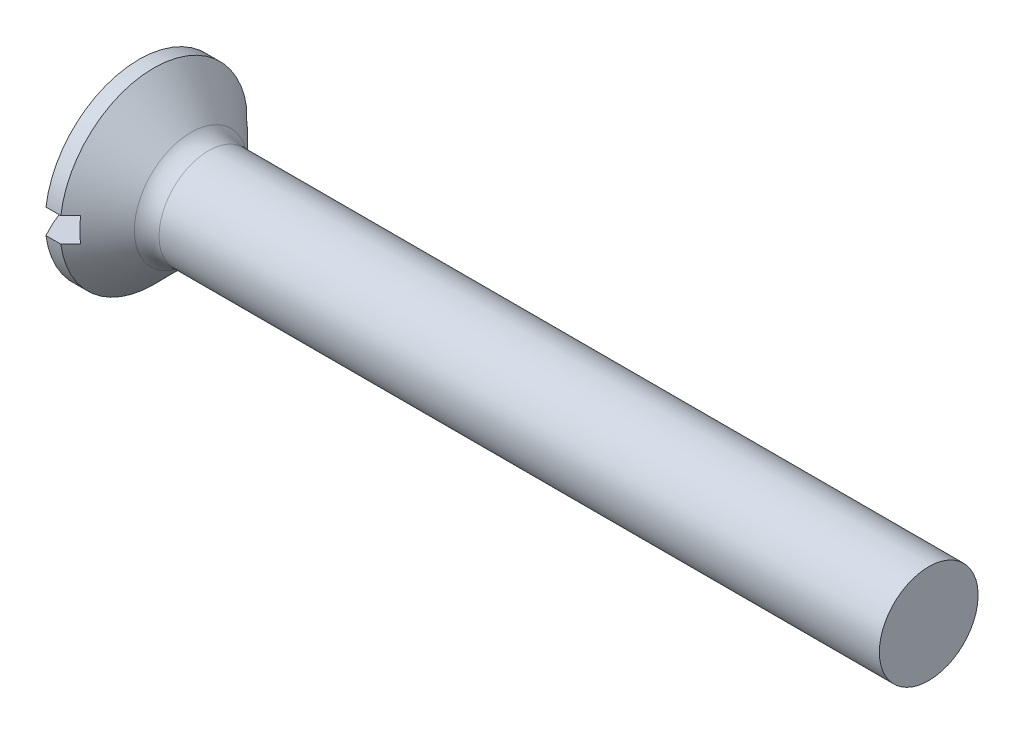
ISO-10303-21;
HEADER;
FILE_DESCRIPTION(('STEP AP214'),'2;1');
FILE_NAME('part.step','',(''),(''),'','','');
FILE_SCHEMA(('AUTOMOTIVE_DESIGN { 1 0 10303 214 1 1 1 1 }'));
ENDSEC;
DATA;
#1=APPLICATION_CONTEXT('core data for automotive mechanical design processes');
#2=APPLICATION_PROTOCOL_DEFINITION('international standard','automotive_design',2000,#1);
#3=PRODUCT_CONTEXT('',#1,'mechanical');
#4=PRODUCT('Part','Part','',(#3));
#5=PRODUCT_RELATED_PRODUCT_CATEGORY('part','',(#4));
#6=PRODUCT_DEFINITION_FORMATION('','',#4);
#7=PRODUCT_DEFINITION_CONTEXT('part definition',#1,'design');
#8=PRODUCT_DEFINITION('design','',#6,#7);
#9=PRODUCT_DEFINITION_SHAPE('','',#8);
#10=(LENGTH_UNIT() NAMED_UNIT(*) SI_UNIT(.MILLI.,.METRE.));
#11=(NAMED_UNIT(*) PLANE_ANGLE_UNIT() SI_UNIT($,.RADIAN.));
#12=(NAMED_UNIT(*) SI_UNIT($,.STERADIAN.) SOLID_ANGLE_UNIT());
#13=UNCERTAINTY_MEASURE_WITH_UNIT(LENGTH_MEASURE(1.E-05),#10,'distance_accuracy_value','');
#14=(GEOMETRIC_REPRESENTATION_CONTEXT(3) GLOBAL_UNCERTAINTY_ASSIGNED_CONTEXT((#13)) GLOBAL_UNIT_ASSIGNED_CONTEXT((#10,
#11,#12)) REPRESENTATION_CONTEXT('',''));
#15=CARTESIAN_POINT('',(0.,0.,0.));
#16=DIRECTION('',(0.,0.,1.));
#17=DIRECTION('',(1.,0.,0.));
#18=AXIS2_PLACEMENT_3D('',#15,#16,#17);
#19=CARTESIAN_POINT('',(3.86,0.,0.));
#20=DIRECTION('',(-1.,0.,0.));
#21=DIRECTION('',(0.,-1.,0.));
#22=AXIS2_PLACEMENT_3D('',#19,#20,#21);
#23=SPHERICAL_SURFACE('',#22,3.86);
#24=CARTESIAN_POINT('',(3.86,0.25,0.));
#25=DIRECTION('',(0.,1.,0.));
#26=DIRECTION('',(0.,0.,1.));
#27=AXIS2_PLACEMENT_3D('',#24,#25,#26);
#28=CIRCLE('',#27,3.85189563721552);
#29=CARTESIAN_POINT('',(0.5,0.25,1.88348082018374));
#30=VERTEX_POINT('',#29);
#31=CARTESIAN_POINT('',(0.5,0.25,-1.88348082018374));
#32=VERTEX_POINT('',#31);
#33=EDGE_CURVE('E180',#30,#32,#28,.F.);
#34=ORIENTED_EDGE('',*,*,#33,.F.);
#35=CARTESIAN_POINT('',(0.5,0.,0.));
#36=DIRECTION('',(-1.,0.,0.));
#37=DIRECTION('',(0.,0.,1.));
#38=AXIS2_PLACEMENT_3D('',#35,#36,#37);
#39=CIRCLE('',#38,1.9);
#40=EDGE_CURVE('E135',#30,#32,#39,.T.);
#41=ORIENTED_EDGE('',*,*,#40,.T.);
#42=EDGE_LOOP('',(#34,#41));
#43=FACE_BOUND('',#42,.T.);
#44=ADVANCED_FACE('F30',(#43),#23,.T.);
#45=CARTESIAN_POINT('',(-15.875,0.,0.));
#46=DIRECTION('',(-1.,0.,0.));
#47=DIRECTION('',(0.,0.,1.));
#48=AXIS2_PLACEMENT_3D('',#45,#46,#47);
#49=CYLINDRICAL_SURFACE('',#48,1.9);
#50=CARTESIAN_POINT('',(0.800000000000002,0.,0.));
#51=DIRECTION('',(-1.,0.,0.));
#52=DIRECTION('',(0.,0.,1.));
#53=AXIS2_PLACEMENT_3D('',#50,#51,#52);
#54=CIRCLE('',#53,1.9);
#55=CARTESIAN_POINT('',(0.800000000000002,0.25,1.88348082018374));
#56=VERTEX_POINT('',#55);
#57=CARTESIAN_POINT('',(0.800000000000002,0.25,-1.88348082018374));
#58=VERTEX_POINT('',#57);
#59=EDGE_CURVE('E106',#56,#58,#54,.T.);
#60=ORIENTED_EDGE('',*,*,#59,.T.);
#61=DIRECTION('',(-1.,0.,0.));
#62=VECTOR('',#61,1.);
#63=CARTESIAN_POINT('',(-15.875,0.25,-1.88348082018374));
#64=LINE('',#63,#62);
#65=EDGE_CURVE('E58',#58,#32,#64,.T.);
#66=ORIENTED_EDGE('',*,*,#65,.T.);
#67=ORIENTED_EDGE('',*,*,#40,.F.);
#68=DIRECTION('',(-1.,0.,0.));
#69=VECTOR('',#68,1.);
#70=CARTESIAN_POINT('',(-15.875,0.25,1.88348082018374));
#71=LINE('',#70,#69);
#72=EDGE_CURVE('E175',#30,#56,#71,.F.);
#73=ORIENTED_EDGE('',*,*,#72,.T.);
#74=EDGE_LOOP('',(#60,#66,#67,#73));
#75=FACE_BOUND('',#74,.T.);
#76=ADVANCED_FACE('F156',(#75),#49,.T.);
#77=CARTESIAN_POINT('',(16.5,0.,0.));
#78=DIRECTION('',(-1.,0.,0.));
#79=DIRECTION('',(0.,0.,1.));
#80=AXIS2_PLACEMENT_3D('',#77,#78,#79);
#81=PLANE('',#80);
#82=CARTESIAN_POINT('',(16.5,0.,0.));
#83=DIRECTION('',(-1.,0.,0.));
#84=DIRECTION('',(0.,0.,1.));
#85=AXIS2_PLACEMENT_3D('',#82,#83,#84);
#86=CIRCLE('',#85,1.);
#87=CARTESIAN_POINT('',(16.5,0.,1.));
#88=VERTEX_POINT('',#87);
#89=EDGE_CURVE('E128',#88,#88,#86,.T.);
#90=ORIENTED_EDGE('',*,*,#89,.F.);
#91=EDGE_LOOP('',(#90));
#92=FACE_BOUND('',#91,.T.);
#93=ADVANCED_FACE('F164',(#92),#81,.F.);
#94=CARTESIAN_POINT('',(3.86,-0.25,0.));
#95=DIRECTION('',(0.,-1.,0.));
#96=DIRECTION('',(0.,0.,-1.));
#97=AXIS2_PLACEMENT_3D('',#94,#95,#96);
#98=CIRCLE('',#97,3.85189563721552);
#99=CARTESIAN_POINT('',(0.5,-0.25,-1.88348082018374));
#100=VERTEX_POINT('',#99);
#101=CARTESIAN_POINT('',(0.5,-0.25,1.88348082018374));
#102=VERTEX_POINT('',#101);
#103=EDGE_CURVE('E126',#100,#102,#98,.F.);
#104=ORIENTED_EDGE('',*,*,#103,.F.);
#105=EDGE_CURVE('E125',#100,#102,#39,.T.);
#106=ORIENTED_EDGE('',*,*,#105,.T.);
#107=EDGE_LOOP('',(#104,#106));
#108=FACE_BOUND('',#107,.T.);
#109=ADVANCED_FACE('F154',(#108),#23,.T.);
#110=CARTESIAN_POINT('',(0.800000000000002,-0.25,-1.88348082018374));
#111=VERTEX_POINT('',#110);
#112=CARTESIAN_POINT('',(0.800000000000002,-0.25,1.88348082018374));
#113=VERTEX_POINT('',#112);
#114=EDGE_CURVE('E123',#111,#113,#54,.T.);
#115=ORIENTED_EDGE('',*,*,#114,.T.);
#116=DIRECTION('',(-1.,0.,0.));
#117=VECTOR('',#116,1.);
#118=CARTESIAN_POINT('',(-15.875,-0.25,1.88348082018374));
#119=LINE('',#118,#117);
#120=EDGE_CURVE('E173',#113,#102,#119,.T.);
#121=ORIENTED_EDGE('',*,*,#120,.T.);
#122=ORIENTED_EDGE('',*,*,#105,.F.);
#123=DIRECTION('',(-1.,0.,0.));
#124=VECTOR('',#123,1.);
#125=CARTESIAN_POINT('',(-15.875,-0.25,-1.88348082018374));
#126=LINE('',#125,#124);
#127=EDGE_CURVE('E115',#100,#111,#126,.F.);
#128=ORIENTED_EDGE('',*,*,#127,.T.);
#129=EDGE_LOOP('',(#115,#121,#122,#128));
#130=FACE_BOUND('',#129,.T.);
#131=ADVANCED_FACE('F121',(#130),#49,.T.);
#132=CARTESIAN_POINT('',(0.800000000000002,0.,0.));
#133=DIRECTION('',(-1.,0.,0.));
#134=DIRECTION('',(0.,0.,1.));
#135=AXIS2_PLACEMENT_3D('',#132,#133,#134);
#136=CONICAL_SURFACE('',#135,1.9,0.78539816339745);
#137=CARTESIAN_POINT('',(-1.48335571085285,0.25,-4.17587894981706));
#138=CARTESIAN_POINT('',(-1.34091780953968,0.25,-4.03318397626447));
#139=CARTESIAN_POINT('',(-1.19849104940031,0.25,-3.89047787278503));
#140=CARTESIAN_POINT('',(-0.913672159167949,0.25,-3.60502718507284));
#141=CARTESIAN_POINT('',(-0.77128002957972,0.25,-3.46228260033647));
#142=CARTESIAN_POINT('',(-0.486502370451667,0.25,-3.17669823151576));
#143=CARTESIAN_POINT('',(-0.344116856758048,0.25,-3.03385843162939));
#144=CARTESIAN_POINT('',(-0.0594245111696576,0.25,-2.74810424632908));
#145=CARTESIAN_POINT('',(0.0828823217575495,0.25,-2.60518986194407));
#146=CARTESIAN_POINT('',(0.370982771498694,0.25,-2.31560790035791));
#147=CARTESIAN_POINT('',(0.516773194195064,0.25,-2.16893714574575));
#148=CARTESIAN_POINT('',(0.808133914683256,0.25,-1.87536527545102));
#149=CARTESIAN_POINT('',(0.953704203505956,0.25,-1.72846415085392));
#150=CARTESIAN_POINT('',(1.17168494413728,0.25,-1.50777115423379));
#151=CARTESIAN_POINT('',(1.2442755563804,0.25,-1.43415726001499));
#152=CARTESIAN_POINT('',(1.38926735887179,0.25,-1.28674053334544));
#153=CARTESIAN_POINT('',(1.46166854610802,0.25,-1.21293769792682));
#154=CARTESIAN_POINT('',(1.60614296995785,0.25,-1.06502260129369));
#155=CARTESIAN_POINT('',(1.67821623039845,0.25,-0.990910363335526));
#156=CARTESIAN_POINT('',(1.82177982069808,0.25,-0.842124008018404));
#157=CARTESIAN_POINT('',(1.89327017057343,0.25,-0.767449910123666));
#158=CARTESIAN_POINT('',(1.98320515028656,0.25,-0.671818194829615));
#159=CARTESIAN_POINT('',(2.00227123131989,0.25,-0.65144645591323));
#160=CARTESIAN_POINT('',(2.04026729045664,0.25,-0.610576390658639));
#161=CARTESIAN_POINT('',(2.0591972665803,0.25,-0.590078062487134));
#162=CARTESIAN_POINT('',(2.11564955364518,0.25,-0.5284372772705));
#163=CARTESIAN_POINT('',(2.15291907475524,0.25,-0.487059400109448));
#164=CARTESIAN_POINT('',(2.21265954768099,0.25,-0.418528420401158));
#165=CARTESIAN_POINT('',(2.23553874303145,0.25,-0.391731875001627));
#166=CARTESIAN_POINT('',(2.28046924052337,0.25,-0.337268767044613));
#167=CARTESIAN_POINT('',(2.30251713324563,0.25,-0.309599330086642));
#168=CARTESIAN_POINT('',(2.33437076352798,0.25,-0.266969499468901));
#169=CARTESIAN_POINT('',(2.34483147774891,0.25,-0.252501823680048));
#170=CARTESIAN_POINT('',(2.3650896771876,0.25,-0.223112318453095));
#171=CARTESIAN_POINT('',(2.37488741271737,0.25,-0.208190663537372));
#172=CARTESIAN_POINT('',(2.39346227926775,0.25,-0.177791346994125));
#173=CARTESIAN_POINT('',(2.40224312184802,0.25,-0.16231599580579));
#174=CARTESIAN_POINT('',(2.41827225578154,0.25,-0.130604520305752));
#175=CARTESIAN_POINT('',(2.42552338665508,0.25,-0.114369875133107));
#176=CARTESIAN_POINT('',(2.4377463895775,0.25,-0.0807694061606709));
#177=CARTESIAN_POINT('',(2.4426867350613,0.25,-0.0633914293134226));
#178=CARTESIAN_POINT('',(2.44901736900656,0.25,-0.0280678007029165));
#179=CARTESIAN_POINT('',(2.45043133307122,0.25,-0.0101267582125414));
#180=CARTESIAN_POINT('',(2.44932721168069,0.25,0.0256677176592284));
#181=CARTESIAN_POINT('',(2.44679929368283,0.25,0.0435208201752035));
#182=CARTESIAN_POINT('',(2.43851921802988,0.25,0.0785328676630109));
#183=CARTESIAN_POINT('',(2.43274442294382,0.25,0.0956860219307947));
#184=CARTESIAN_POINT('',(2.41763500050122,0.25,0.132554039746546));
#185=CARTESIAN_POINT('',(2.40780938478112,0.25,0.152058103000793));
#186=CARTESIAN_POINT('',(2.38634722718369,0.25,0.190062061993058));
#187=CARTESIAN_POINT('',(2.3747061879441,0.25,0.20855930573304));
#188=CARTESIAN_POINT('',(2.3502618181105,0.25,0.24494724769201));
#189=CARTESIAN_POINT('',(2.3374508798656,0.25,0.262832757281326));
#190=CARTESIAN_POINT('',(2.31115223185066,0.25,0.298056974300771));
#191=CARTESIAN_POINT('',(2.29766540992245,0.25,0.315396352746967));
#192=CARTESIAN_POINT('',(2.25226424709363,0.25,0.372219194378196));
#193=CARTESIAN_POINT('',(2.2193791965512,0.25,0.410921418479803));
#194=CARTESIAN_POINT('',(2.1525335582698,0.25,0.487389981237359));
#195=CARTESIAN_POINT('',(2.11857252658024,0.25,0.525155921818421));
#196=CARTESIAN_POINT('',(2.05000356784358,0.25,0.600190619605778));
#197=CARTESIAN_POINT('',(2.01539482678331,0.25,0.63745863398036));
#198=CARTESIAN_POINT('',(1.94582440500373,0.25,0.711648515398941));
#199=CARTESIAN_POINT('',(1.9108627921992,0.25,0.748570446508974));
#200=CARTESIAN_POINT('',(1.80607213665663,0.25,0.858550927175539));
#201=CARTESIAN_POINT('',(1.73590607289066,0.25,0.931288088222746));
#202=CARTESIAN_POINT('',(1.59518965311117,0.25,1.07628878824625));
#203=CARTESIAN_POINT('',(1.52463960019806,0.25,1.14855262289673));
#204=CARTESIAN_POINT('',(1.33310092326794,0.25,1.34407689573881));
#205=CARTESIAN_POINT('',(1.21187584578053,0.25,1.46710567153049));
#206=CARTESIAN_POINT('',(0.969103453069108,0.25,1.71284625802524));
#207=CARTESIAN_POINT('',(0.847556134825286,0.25,1.83555806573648));
#208=CARTESIAN_POINT('',(0.482574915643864,0.25,2.20351484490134));
#209=CARTESIAN_POINT('',(0.23888045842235,0.25,2.44850137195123));
#210=CARTESIAN_POINT('',(-0.251201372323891,0.25,2.94067453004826));
#211=CARTESIAN_POINT('',(-0.497591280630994,0.25,3.18785863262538));
#212=CARTESIAN_POINT('',(-0.990433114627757,0.25,3.68199435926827));
#213=CARTESIAN_POINT('',(-1.23688498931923,0.25,3.92894603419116));
#214=CARTESIAN_POINT('',(-1.48335571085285,0.25,4.17587894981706));
#215=B_SPLINE_CURVE_WITH_KNOTS('',3,(#137,#138,#139,#140,#141,#142,#143,#144,#145,#146,#147,
#148,#149,#150,#151,#152,#153,#154,#155,#156,#157,#158,#159,#160,#161,#162,#163,#164,#165,#166,
#167,#168,#169,#170,#171,#172,#173,#174,#175,#176,#177,#178,#179,#180,#181,#182,#183,#184,#185,
#186,#187,#188,#189,#190,#191,#192,#193,#194,#195,#196,#197,#198,#199,#200,#201,#202,#203,#204,
#205,#206,#207,#208,#209,#210,#211,#212,#213,#214),.UNSPECIFIED.,.F.,.F.,(4,2,2,2,2,2,2,2,2,2,2,
2,2,2,2,2,2,2,2,2,2,2,2,2,2,2,2,2,2,2,2,2,2,2,2,2,2,2,4),(0.,0.604858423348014,1.20972518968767,
1.81478020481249,2.41982708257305,3.04023369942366,3.66066494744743,3.97081901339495,
4.28097798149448,4.59111404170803,4.90123940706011,4.98494476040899,5.06865132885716,
5.23569422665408,5.34139201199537,5.44748437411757,5.50103219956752,5.55455969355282,
5.60788521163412,5.66111085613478,5.71504288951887,5.7686118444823,5.82231463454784,
5.87639657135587,5.94174552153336,6.00725901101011,6.07323385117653,6.13912418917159,
6.2914266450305,6.4437927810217,6.5963653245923,6.74890904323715,7.05209651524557,
7.3550719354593,7.87322475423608,8.39138244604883,9.42803408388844,10.4750640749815,
11.5217315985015),.UNSPECIFIED.);
#216=CARTESIAN_POINT('',(1.,0.25,-1.68151717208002));
#217=VERTEX_POINT('',#216);
#218=EDGE_CURVE('E11',#58,#217,#215,.T.);
#219=ORIENTED_EDGE('',*,*,#218,.F.);
#220=ORIENTED_EDGE('',*,*,#59,.F.);
#221=CARTESIAN_POINT('',(1.,0.25,1.68151717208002));
#222=VERTEX_POINT('',#221);
#223=EDGE_CURVE('E34',#222,#56,#215,.T.);
#224=ORIENTED_EDGE('',*,*,#223,.F.);
#225=CARTESIAN_POINT('',(1.,0.,0.));
#226=DIRECTION('',(-1.,0.,0.));
#227=DIRECTION('',(0.,0.,1.));
#228=AXIS2_PLACEMENT_3D('',#225,#226,#227);
#229=CIRCLE('',#228,1.7);
#230=CARTESIAN_POINT('',(1.,-0.25,1.68151717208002));
#231=VERTEX_POINT('',#230);
#232=EDGE_CURVE('E87',#222,#231,#229,.F.);
#233=ORIENTED_EDGE('',*,*,#232,.T.);
#234=CARTESIAN_POINT('',(-1.48335571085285,-0.25,4.17587894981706));
#235=CARTESIAN_POINT('',(-1.34091780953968,-0.25,4.03318397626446));
#236=CARTESIAN_POINT('',(-1.19849104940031,-0.25,3.89047787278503));
#237=CARTESIAN_POINT('',(-0.913672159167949,-0.25,3.60502718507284));
#238=CARTESIAN_POINT('',(-0.77128002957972,-0.25,3.46228260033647));
#239=CARTESIAN_POINT('',(-0.486502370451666,-0.25,3.17669823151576));
#240=CARTESIAN_POINT('',(-0.344116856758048,-0.25,3.03385843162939));
#241=CARTESIAN_POINT('',(-0.0594245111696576,-0.25,2.74810424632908));
#242=CARTESIAN_POINT('',(0.0828823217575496,-0.25,2.60518986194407));
#243=CARTESIAN_POINT('',(0.370982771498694,-0.25,2.31560790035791));
#244=CARTESIAN_POINT('',(0.516773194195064,-0.25,2.16893714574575));
#245=CARTESIAN_POINT('',(0.808133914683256,-0.25,1.87536527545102));
#246=CARTESIAN_POINT('',(0.953704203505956,-0.25,1.72846415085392));
#247=CARTESIAN_POINT('',(1.17168494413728,-0.25,1.50777115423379));
#248=CARTESIAN_POINT('',(1.2442755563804,-0.25,1.43415726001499));
#249=CARTESIAN_POINT('',(1.38926735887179,-0.25,1.28674053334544));
#250=CARTESIAN_POINT('',(1.46166854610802,-0.25,1.21293769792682));
#251=CARTESIAN_POINT('',(1.60614296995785,-0.25,1.06502260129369));
#252=CARTESIAN_POINT('',(1.67821623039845,-0.25,0.990910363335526));
#253=CARTESIAN_POINT('',(1.82177982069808,-0.25,0.842124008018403));
#254=CARTESIAN_POINT('',(1.89327017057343,-0.25,0.767449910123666));
#255=CARTESIAN_POINT('',(1.98320515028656,-0.25,0.671818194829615));
#256=CARTESIAN_POINT('',(2.00227123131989,-0.25,0.65144645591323));
#257=CARTESIAN_POINT('',(2.04026729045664,-0.25,0.610576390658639));
#258=CARTESIAN_POINT('',(2.0591972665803,-0.25,0.590078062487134));
#259=CARTESIAN_POINT('',(2.11564955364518,-0.25,0.528437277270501));
#260=CARTESIAN_POINT('',(2.15291907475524,-0.25,0.487059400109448));
#261=CARTESIAN_POINT('',(2.21265954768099,-0.25,0.418528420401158));
#262=CARTESIAN_POINT('',(2.23553874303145,-0.25,0.391731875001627));
#263=CARTESIAN_POINT('',(2.28046924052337,-0.25,0.337268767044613));
#264=CARTESIAN_POINT('',(2.30251713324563,-0.25,0.309599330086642));
#265=CARTESIAN_POINT('',(2.33437076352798,-0.25,0.266969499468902));
#266=CARTESIAN_POINT('',(2.34483147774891,-0.25,0.252501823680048));
#267=CARTESIAN_POINT('',(2.3650896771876,-0.25,0.223112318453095));
#268=CARTESIAN_POINT('',(2.37488741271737,-0.25,0.208190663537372));
#269=CARTESIAN_POINT('',(2.39346227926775,-0.25,0.177791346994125));
#270=CARTESIAN_POINT('',(2.40224312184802,-0.25,0.162315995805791));
#271=CARTESIAN_POINT('',(2.41827225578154,-0.25,0.130604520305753));
#272=CARTESIAN_POINT('',(2.42552338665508,-0.25,0.114369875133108));
#273=CARTESIAN_POINT('',(2.4377463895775,-0.25,0.0807694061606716));
#274=CARTESIAN_POINT('',(2.4426867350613,-0.25,0.0633914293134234));
#275=CARTESIAN_POINT('',(2.44901736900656,-0.25,0.0280678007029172));
#276=CARTESIAN_POINT('',(2.45043133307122,-0.25,0.0101267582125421));
#277=CARTESIAN_POINT('',(2.44932721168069,-0.25,-0.0256677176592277));
#278=CARTESIAN_POINT('',(2.44679929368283,-0.25,-0.0435208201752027));
#279=CARTESIAN_POINT('',(2.43851921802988,-0.25,-0.0785328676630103));
#280=CARTESIAN_POINT('',(2.43274442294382,-0.25,-0.0956860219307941));
#281=CARTESIAN_POINT('',(2.41763500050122,-0.25,-0.132554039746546));
#282=CARTESIAN_POINT('',(2.40780938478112,-0.25,-0.152058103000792));
#283=CARTESIAN_POINT('',(2.38634722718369,-0.25,-0.190062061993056));
#284=CARTESIAN_POINT('',(2.3747061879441,-0.25,-0.208559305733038));
#285=CARTESIAN_POINT('',(2.3502618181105,-0.25,-0.244947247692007));
#286=CARTESIAN_POINT('',(2.3374508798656,-0.25,-0.262832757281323));
#287=CARTESIAN_POINT('',(2.31115223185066,-0.25,-0.298056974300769));
#288=CARTESIAN_POINT('',(2.29766540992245,-0.25,-0.315396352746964));
#289=CARTESIAN_POINT('',(2.25226424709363,-0.25,-0.372219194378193));
#290=CARTESIAN_POINT('',(2.21937919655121,-0.25,-0.4109214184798));
#291=CARTESIAN_POINT('',(2.15253355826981,-0.25,-0.487389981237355));
#292=CARTESIAN_POINT('',(2.11857252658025,-0.25,-0.525155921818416));
#293=CARTESIAN_POINT('',(2.05000356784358,-0.25,-0.600190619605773));
#294=CARTESIAN_POINT('',(2.01539482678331,-0.25,-0.637458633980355));
#295=CARTESIAN_POINT('',(1.94582440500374,-0.25,-0.711648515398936));
#296=CARTESIAN_POINT('',(1.91086279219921,-0.25,-0.748570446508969));
#297=CARTESIAN_POINT('',(1.80607213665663,-0.25,-0.858550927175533));
#298=CARTESIAN_POINT('',(1.73590607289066,-0.25,-0.931288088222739));
#299=CARTESIAN_POINT('',(1.59518965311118,-0.25,-1.07628878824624));
#300=CARTESIAN_POINT('',(1.52463960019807,-0.25,-1.14855262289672));
#301=CARTESIAN_POINT('',(1.33310092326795,-0.25,-1.3440768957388));
#302=CARTESIAN_POINT('',(1.21187584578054,-0.25,-1.46710567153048));
#303=CARTESIAN_POINT('',(0.969103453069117,-0.25,-1.71284625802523));
#304=CARTESIAN_POINT('',(0.847556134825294,-0.25,-1.83555806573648));
#305=CARTESIAN_POINT('',(0.482574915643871,-0.25,-2.20351484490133));
#306=CARTESIAN_POINT('',(0.238880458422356,-0.249999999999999,-2.44850137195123));
#307=CARTESIAN_POINT('',(-0.251201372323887,-0.249999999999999,-2.94067453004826));
#308=CARTESIAN_POINT('',(-0.497591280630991,-0.249999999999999,-3.18785863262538));
#309=CARTESIAN_POINT('',(-0.990433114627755,-0.249999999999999,-3.68199435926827));
#310=CARTESIAN_POINT('',(-1.23688498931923,-0.249999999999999,-3.92894603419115));
#311=CARTESIAN_POINT('',(-1.48335571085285,-0.249999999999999,-4.17587894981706));
#312=B_SPLINE_CURVE_WITH_KNOTS('',3,(#234,#235,#236,#237,#238,#239,#240,#241,#242,#243,#244,
#245,#246,#247,#248,#249,#250,#251,#252,#253,#254,#255,#256,#257,#258,#259,#260,#261,#262,#263,
#264,#265,#266,#267,#268,#269,#270,#271,#272,#273,#274,#275,#276,#277,#278,#279,#280,#281,#282,
#283,#284,#285,#286,#287,#288,#289,#290,#291,#292,#293,#294,#295,#296,#297,#298,#299,#300,#301,
#302,#303,#304,#305,#306,#307,#308,#309,#310,#311),.UNSPECIFIED.,.F.,.F.,(4,2,2,2,2,2,2,2,2,2,2,
2,2,2,2,2,2,2,2,2,2,2,2,2,2,2,2,2,2,2,2,2,2,2,2,2,2,2,4),(0.,0.604858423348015,1.20972518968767,
1.81478020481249,2.41982708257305,3.04023369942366,3.66066494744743,3.97081901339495,
4.28097798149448,4.59111404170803,4.90123940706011,4.984944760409,5.06865132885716,
5.23569422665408,5.34139201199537,5.44748437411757,5.50103219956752,5.55455969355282,
5.60788521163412,5.66111085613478,5.71504288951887,5.7686118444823,5.82231463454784,
5.87639657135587,5.94174552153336,6.00725901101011,6.07323385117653,6.13912418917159,
6.29142664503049,6.4437927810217,6.5963653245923,6.74890904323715,7.05209651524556,
7.35507193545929,7.87322475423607,8.39138244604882,9.42803408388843,10.4750640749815,
11.5217315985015),.UNSPECIFIED.);
#313=EDGE_CURVE('E95',#113,#231,#312,.T.);
#314=ORIENTED_EDGE('',*,*,#313,.F.);
#315=ORIENTED_EDGE('',*,*,#114,.F.);
#316=CARTESIAN_POINT('',(1.,-0.25,-1.68151717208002));
#317=VERTEX_POINT('',#316);
#318=EDGE_CURVE('E44',#317,#111,#312,.T.);
#319=ORIENTED_EDGE('',*,*,#318,.F.);
#320=EDGE_CURVE('E98',#317,#217,#229,.F.);
#321=ORIENTED_EDGE('',*,*,#320,.T.);
#322=EDGE_LOOP('',(#219,#220,#224,#233,#314,#315,#319,#321));
#323=FACE_BOUND('',#322,.T.);
#324=CARTESIAN_POINT('',(1.55355339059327,0.,0.));
#325=DIRECTION('',(1.,0.,0.));
#326=DIRECTION('',(0.,0.,-1.));
#327=AXIS2_PLACEMENT_3D('',#324,#325,#326);
#328=CIRCLE('',#327,1.14644660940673);
#329=CARTESIAN_POINT('',(1.55355339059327,0.,-1.14644660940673));
#330=VERTEX_POINT('',#329);
#331=EDGE_CURVE('E136',#330,#330,#328,.F.);
#332=ORIENTED_EDGE('',*,*,#331,.T.);
#333=EDGE_LOOP('',(#332));
#334=FACE_BOUND('',#333,.T.);
#335=ADVANCED_FACE('F103',(#323,#334),#136,.T.);
#336=CARTESIAN_POINT('',(-15.875,0.,0.));
#337=DIRECTION('',(-1.,0.,0.));
#338=DIRECTION('',(0.,0.,1.));
#339=AXIS2_PLACEMENT_3D('',#336,#337,#338);
#340=CYLINDRICAL_SURFACE('',#339,0.999999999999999);
#341=CARTESIAN_POINT('',(1.90710678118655,0.,0.));
#342=DIRECTION('',(-1.,0.,0.));
#343=DIRECTION('',(0.,0.,1.));
#344=AXIS2_PLACEMENT_3D('',#341,#342,#343);
#345=CIRCLE('',#344,0.999999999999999);
#346=CARTESIAN_POINT('',(1.90710678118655,0.,0.999999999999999));
#347=VERTEX_POINT('',#346);
#348=EDGE_CURVE('E96',#347,#347,#345,.F.);
#349=ORIENTED_EDGE('',*,*,#348,.T.);
#350=EDGE_LOOP('',(#349));
#351=FACE_BOUND('',#350,.T.);
#352=ORIENTED_EDGE('',*,*,#89,.T.);
#353=EDGE_LOOP('',(#352));
#354=FACE_BOUND('',#353,.T.);
#355=ADVANCED_FACE('F142',(#351,#354),#340,.T.);
#356=CARTESIAN_POINT('',(1.90710678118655,0.,0.));
#357=DIRECTION('',(-1.,0.,0.));
#358=DIRECTION('',(0.,0.,1.));
#359=AXIS2_PLACEMENT_3D('',#356,#357,#358);
#360=TOROIDAL_SURFACE('',#359,1.5,0.5);
#361=ORIENTED_EDGE('',*,*,#348,.F.);
#362=EDGE_LOOP('',(#361));
#363=FACE_BOUND('',#362,.T.);
#364=ORIENTED_EDGE('',*,*,#331,.F.);
#365=EDGE_LOOP('',(#364));
#366=FACE_BOUND('',#365,.T.);
#367=ADVANCED_FACE('F32',(#363,#366),#360,.F.);
#368=CARTESIAN_POINT('',(1.,0.25,1.9));
#369=DIRECTION('',(0.,1.,0.));
#370=DIRECTION('',(0.,0.,1.));
#371=AXIS2_PLACEMENT_3D('',#368,#369,#370);
#372=PLANE('',#371);
#373=ORIENTED_EDGE('',*,*,#218,.T.);
#374=DIRECTION('',(0.,0.,-1.));
#375=VECTOR('',#374,1.);
#376=CARTESIAN_POINT('',(1.,0.25,1.9));
#377=LINE('',#376,#375);
#378=EDGE_CURVE('E90',#222,#217,#377,.T.);
#379=ORIENTED_EDGE('',*,*,#378,.F.);
#380=ORIENTED_EDGE('',*,*,#223,.T.);
#381=ORIENTED_EDGE('',*,*,#72,.F.);
#382=ORIENTED_EDGE('',*,*,#33,.T.);
#383=ORIENTED_EDGE('',*,*,#65,.F.);
#384=EDGE_LOOP('',(#373,#379,#380,#381,#382,#383));
#385=FACE_BOUND('',#384,.T.);
#386=ADVANCED_FACE('F99',(#385),#372,.F.);
#387=CARTESIAN_POINT('',(1.,-0.25,-1.9));
#388=DIRECTION('',(0.,-1.,0.));
#389=DIRECTION('',(0.,0.,-1.));
#390=AXIS2_PLACEMENT_3D('',#387,#388,#389);
#391=PLANE('',#390);
#392=ORIENTED_EDGE('',*,*,#313,.T.);
#393=DIRECTION('',(0.,0.,1.));
#394=VECTOR('',#393,1.);
#395=CARTESIAN_POINT('',(1.,-0.25,-1.9));
#396=LINE('',#395,#394);
#397=EDGE_CURVE('E51',#317,#231,#396,.T.);
#398=ORIENTED_EDGE('',*,*,#397,.F.);
#399=ORIENTED_EDGE('',*,*,#318,.T.);
#400=ORIENTED_EDGE('',*,*,#127,.F.);
#401=ORIENTED_EDGE('',*,*,#103,.T.);
#402=ORIENTED_EDGE('',*,*,#120,.F.);
#403=EDGE_LOOP('',(#392,#398,#399,#400,#401,#402));
#404=FACE_BOUND('',#403,.T.);
#405=ADVANCED_FACE('F114',(#404),#391,.F.);
#406=CARTESIAN_POINT('',(1.,0.25,-1.9));
#407=DIRECTION('',(-1.,0.,0.));
#408=DIRECTION('',(0.,0.,1.));
#409=AXIS2_PLACEMENT_3D('',#406,#407,#408);
#410=PLANE('',#409);
#411=ORIENTED_EDGE('',*,*,#397,.T.);
#412=ORIENTED_EDGE('',*,*,#232,.F.);
#413=ORIENTED_EDGE('',*,*,#378,.T.);
#414=ORIENTED_EDGE('',*,*,#320,.F.);
#415=EDGE_LOOP('',(#411,#412,#413,#414));
#416=FACE_BOUND('',#415,.T.);
#417=ADVANCED_FACE('F89',(#416),#410,.T.);
#418=CLOSED_SHELL('',(#44,#76,#93,#109,#131,#335,#355,#367,#386,#405,#417));
#419=MANIFOLD_SOLID_BREP('B2',#418);
#420=ADVANCED_BREP_SHAPE_REPRESENTATION('',(#18,#419),#14);
#421=SHAPE_DEFINITION_REPRESENTATION(#9,#420);
ENDSEC;
END-ISO-10303-21;
